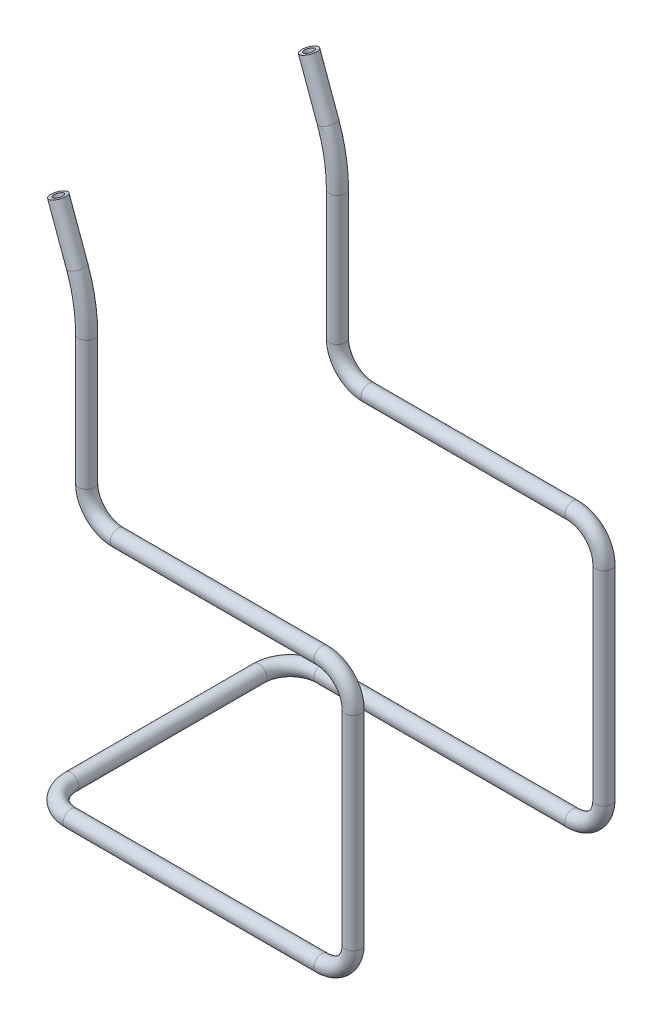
from build123d import *

# Parameters (mm, degrees)
SWEEP_THIN1_PROFILE_R   = 2.5
SWEEP_THIN1_PROFILE_R_2 = 1.5


with BuildPart() as part:
    # Sweep-Thin1: sweep along a curve in space
    with BuildLine() as sweep_thin1_path:
        Line((0, 0, 0), (0, 0, 30))
        ThreePointArc((0, 0, 30), (2.928932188, 0, 37.071067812), (10, 0, 40))
        Line((10, 0, 40), (90, 0, 40))
        ThreePointArc((90, 0, 40), (97.071067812, 2.928932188, 40), (100, 10, 40))
        Line((100, 10, 40), (100, 75, 40))
        ThreePointArc((100, 75, 40), (97.071067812, 82.071067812, 40), (90, 85, 40))
        Line((90, 85, 40), (25, 85, 40))
        ThreePointArc((25, 85, 40), (17.928932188, 87.928932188, 40), (15, 95, 40))
        Line((15, 95, 40), (15, 136.17811304, 40))
        ThreePointArc((15, 136.17811304, 40), (14.240387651, 144.860521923, 40), (11.984631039, 153.279120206, 40))
        Line((11.984631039, 153.279120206, 40), (5.936466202, 169.896316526, 40))
    # Sweep-Thin1 profile (on start of the path) → Sweep-Thin1 (sweep)
    with BuildSketch(Plane.XY):
        Circle(SWEEP_THIN1_PROFILE_R)
        Circle(SWEEP_THIN1_PROFILE_R_2, mode=Mode.SUBTRACT)
    sweep_thin1 = sweep(path=sweep_thin1_path.line)

    # Mirror1: Sweep-Thin1 across plane
    add(sweep_thin1.mirror(Plane.XY))


solid = part.part
